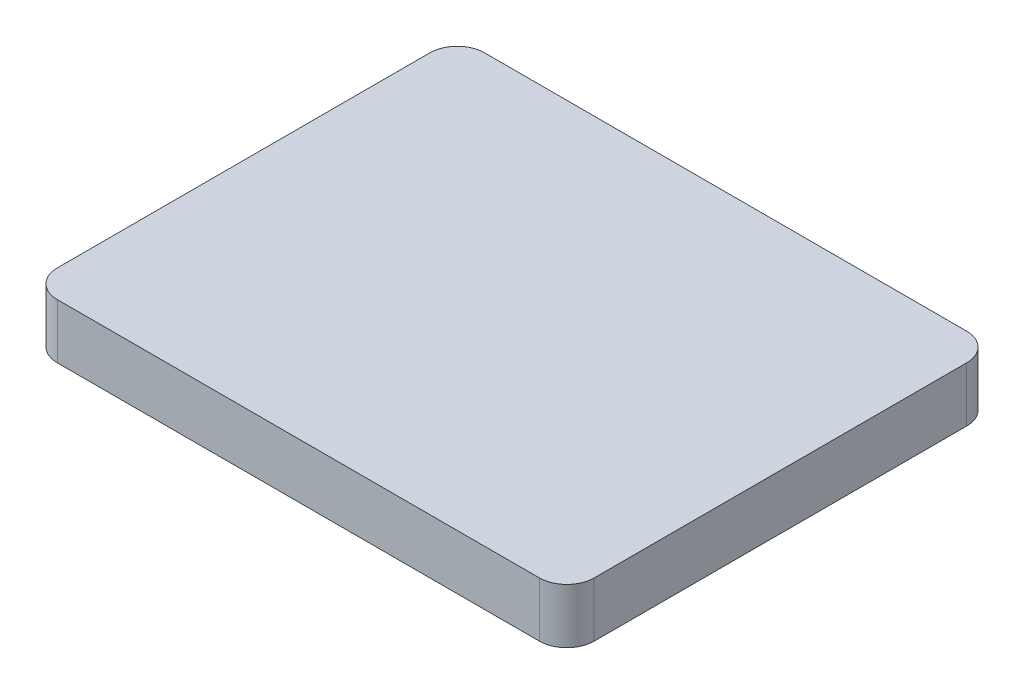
ISO-10303-21;
HEADER;
FILE_DESCRIPTION(('STEP AP214'),'2;1');
FILE_NAME('part.step','',(''),(''),'','','');
FILE_SCHEMA(('AUTOMOTIVE_DESIGN { 1 0 10303 214 1 1 1 1 }'));
ENDSEC;
DATA;
#1=APPLICATION_CONTEXT('core data for automotive mechanical design processes');
#2=APPLICATION_PROTOCOL_DEFINITION('international standard','automotive_design',2000,#1);
#3=PRODUCT_CONTEXT('',#1,'mechanical');
#4=PRODUCT('Part','Part','',(#3));
#5=PRODUCT_RELATED_PRODUCT_CATEGORY('part','',(#4));
#6=PRODUCT_DEFINITION_FORMATION('','',#4);
#7=PRODUCT_DEFINITION_CONTEXT('part definition',#1,'design');
#8=PRODUCT_DEFINITION('design','',#6,#7);
#9=PRODUCT_DEFINITION_SHAPE('','',#8);
#10=(LENGTH_UNIT() NAMED_UNIT(*) SI_UNIT(.MILLI.,.METRE.));
#11=(NAMED_UNIT(*) PLANE_ANGLE_UNIT() SI_UNIT($,.RADIAN.));
#12=(NAMED_UNIT(*) SI_UNIT($,.STERADIAN.) SOLID_ANGLE_UNIT());
#13=UNCERTAINTY_MEASURE_WITH_UNIT(LENGTH_MEASURE(1.E-05),#10,'distance_accuracy_value','');
#14=(GEOMETRIC_REPRESENTATION_CONTEXT(3) GLOBAL_UNCERTAINTY_ASSIGNED_CONTEXT((#13)) GLOBAL_UNIT_ASSIGNED_CONTEXT((#10,
#11,#12)) REPRESENTATION_CONTEXT('',''));
#15=CARTESIAN_POINT('',(0.,0.,0.));
#16=DIRECTION('',(0.,0.,1.));
#17=DIRECTION('',(1.,0.,0.));
#18=AXIS2_PLACEMENT_3D('',#15,#16,#17);
#19=CARTESIAN_POINT('',(4.9,1.,-3.9));
#20=DIRECTION('',(-1.,0.,0.));
#21=DIRECTION('',(0.,0.,1.));
#22=AXIS2_PLACEMENT_3D('',#19,#20,#21);
#23=PLANE('',#22);
#24=DIRECTION('',(0.,0.,-1.));
#25=VECTOR('',#24,1.);
#26=CARTESIAN_POINT('',(4.9,0.,-3.9));
#27=LINE('',#26,#25);
#28=CARTESIAN_POINT('',(4.9,0.,3.4));
#29=VERTEX_POINT('',#28);
#30=CARTESIAN_POINT('',(4.9,0.,-3.4));
#31=VERTEX_POINT('',#30);
#32=EDGE_CURVE('E127',#29,#31,#27,.T.);
#33=ORIENTED_EDGE('',*,*,#32,.T.);
#34=DIRECTION('',(0.,-1.,0.));
#35=VECTOR('',#34,1.);
#36=CARTESIAN_POINT('',(4.9,1.,-3.4));
#37=LINE('',#36,#35);
#38=CARTESIAN_POINT('',(4.9,1.,-3.4));
#39=VERTEX_POINT('',#38);
#40=EDGE_CURVE('E105',#31,#39,#37,.F.);
#41=ORIENTED_EDGE('',*,*,#40,.T.);
#42=DIRECTION('',(0.,0.,-1.));
#43=VECTOR('',#42,1.);
#44=CARTESIAN_POINT('',(4.9,1.,-3.9));
#45=LINE('',#44,#43);
#46=CARTESIAN_POINT('',(4.9,1.,3.4));
#47=VERTEX_POINT('',#46);
#48=EDGE_CURVE('E136',#47,#39,#45,.T.);
#49=ORIENTED_EDGE('',*,*,#48,.F.);
#50=DIRECTION('',(0.,-1.,0.));
#51=VECTOR('',#50,1.);
#52=CARTESIAN_POINT('',(4.9,1.,3.4));
#53=LINE('',#52,#51);
#54=EDGE_CURVE('E110',#47,#29,#53,.T.);
#55=ORIENTED_EDGE('',*,*,#54,.T.);
#56=EDGE_LOOP('',(#33,#41,#49,#55));
#57=FACE_BOUND('',#56,.T.);
#58=ADVANCED_FACE('F34',(#57),#23,.F.);
#59=CARTESIAN_POINT('',(-4.9,1.,-3.9));
#60=DIRECTION('',(0.,0.,1.));
#61=DIRECTION('',(1.,0.,0.));
#62=AXIS2_PLACEMENT_3D('',#59,#60,#61);
#63=PLANE('',#62);
#64=DIRECTION('',(-1.,0.,0.));
#65=VECTOR('',#64,1.);
#66=CARTESIAN_POINT('',(-4.9,1.,-3.9));
#67=LINE('',#66,#65);
#68=CARTESIAN_POINT('',(4.4,1.,-3.9));
#69=VERTEX_POINT('',#68);
#70=CARTESIAN_POINT('',(-4.4,1.,-3.9));
#71=VERTEX_POINT('',#70);
#72=EDGE_CURVE('E120',#69,#71,#67,.T.);
#73=ORIENTED_EDGE('',*,*,#72,.F.);
#74=DIRECTION('',(0.,-1.,0.));
#75=VECTOR('',#74,1.);
#76=CARTESIAN_POINT('',(4.4,1.,-3.9));
#77=LINE('',#76,#75);
#78=CARTESIAN_POINT('',(4.4,0.,-3.9));
#79=VERTEX_POINT('',#78);
#80=EDGE_CURVE('E104',#69,#79,#77,.T.);
#81=ORIENTED_EDGE('',*,*,#80,.T.);
#82=DIRECTION('',(-1.,0.,0.));
#83=VECTOR('',#82,1.);
#84=CARTESIAN_POINT('',(-4.9,0.,-3.9));
#85=LINE('',#84,#83);
#86=CARTESIAN_POINT('',(-4.4,0.,-3.9));
#87=VERTEX_POINT('',#86);
#88=EDGE_CURVE('E117',#79,#87,#85,.T.);
#89=ORIENTED_EDGE('',*,*,#88,.T.);
#90=DIRECTION('',(0.,-1.,0.));
#91=VECTOR('',#90,1.);
#92=CARTESIAN_POINT('',(-4.4,1.,-3.9));
#93=LINE('',#92,#91);
#94=EDGE_CURVE('E122',#87,#71,#93,.F.);
#95=ORIENTED_EDGE('',*,*,#94,.T.);
#96=EDGE_LOOP('',(#73,#81,#89,#95));
#97=FACE_BOUND('',#96,.T.);
#98=ADVANCED_FACE('F116',(#97),#63,.F.);
#99=CARTESIAN_POINT('',(-4.9,1.,-3.9));
#100=DIRECTION('',(1.,0.,0.));
#101=DIRECTION('',(0.,0.,-1.));
#102=AXIS2_PLACEMENT_3D('',#99,#100,#101);
#103=PLANE('',#102);
#104=DIRECTION('',(0.,0.,1.));
#105=VECTOR('',#104,1.);
#106=CARTESIAN_POINT('',(-4.9,1.,-3.9));
#107=LINE('',#106,#105);
#108=CARTESIAN_POINT('',(-4.9,1.,-3.4));
#109=VERTEX_POINT('',#108);
#110=CARTESIAN_POINT('',(-4.9,1.,3.4));
#111=VERTEX_POINT('',#110);
#112=EDGE_CURVE('E162',#109,#111,#107,.T.);
#113=ORIENTED_EDGE('',*,*,#112,.F.);
#114=DIRECTION('',(0.,-1.,0.));
#115=VECTOR('',#114,1.);
#116=CARTESIAN_POINT('',(-4.9,1.,-3.4));
#117=LINE('',#116,#115);
#118=CARTESIAN_POINT('',(-4.9,0.,-3.4));
#119=VERTEX_POINT('',#118);
#120=EDGE_CURVE('E155',#109,#119,#117,.T.);
#121=ORIENTED_EDGE('',*,*,#120,.T.);
#122=DIRECTION('',(0.,0.,1.));
#123=VECTOR('',#122,1.);
#124=CARTESIAN_POINT('',(-4.9,0.,-3.9));
#125=LINE('',#124,#123);
#126=CARTESIAN_POINT('',(-4.9,0.,3.4));
#127=VERTEX_POINT('',#126);
#128=EDGE_CURVE('E126',#119,#127,#125,.T.);
#129=ORIENTED_EDGE('',*,*,#128,.T.);
#130=DIRECTION('',(0.,-1.,0.));
#131=VECTOR('',#130,1.);
#132=CARTESIAN_POINT('',(-4.9,1.,3.4));
#133=LINE('',#132,#131);
#134=EDGE_CURVE('E153',#127,#111,#133,.F.);
#135=ORIENTED_EDGE('',*,*,#134,.T.);
#136=EDGE_LOOP('',(#113,#121,#129,#135));
#137=FACE_BOUND('',#136,.T.);
#138=ADVANCED_FACE('F160',(#137),#103,.F.);
#139=CARTESIAN_POINT('',(-4.9,1.,3.9));
#140=DIRECTION('',(0.,0.,-1.));
#141=DIRECTION('',(-1.,0.,0.));
#142=AXIS2_PLACEMENT_3D('',#139,#140,#141);
#143=PLANE('',#142);
#144=DIRECTION('',(1.,0.,0.));
#145=VECTOR('',#144,1.);
#146=CARTESIAN_POINT('',(-4.9,1.,3.9));
#147=LINE('',#146,#145);
#148=CARTESIAN_POINT('',(-4.4,1.,3.9));
#149=VERTEX_POINT('',#148);
#150=CARTESIAN_POINT('',(4.4,1.,3.9));
#151=VERTEX_POINT('',#150);
#152=EDGE_CURVE('E137',#149,#151,#147,.T.);
#153=ORIENTED_EDGE('',*,*,#152,.F.);
#154=DIRECTION('',(0.,-1.,0.));
#155=VECTOR('',#154,1.);
#156=CARTESIAN_POINT('',(-4.4,1.,3.9));
#157=LINE('',#156,#155);
#158=CARTESIAN_POINT('',(-4.4,0.,3.9));
#159=VERTEX_POINT('',#158);
#160=EDGE_CURVE('E11',#149,#159,#157,.T.);
#161=ORIENTED_EDGE('',*,*,#160,.T.);
#162=DIRECTION('',(1.,0.,0.));
#163=VECTOR('',#162,1.);
#164=CARTESIAN_POINT('',(-4.9,0.,3.9));
#165=LINE('',#164,#163);
#166=CARTESIAN_POINT('',(4.4,0.,3.9));
#167=VERTEX_POINT('',#166);
#168=EDGE_CURVE('E130',#159,#167,#165,.T.);
#169=ORIENTED_EDGE('',*,*,#168,.T.);
#170=DIRECTION('',(0.,-1.,0.));
#171=VECTOR('',#170,1.);
#172=CARTESIAN_POINT('',(4.4,1.,3.9));
#173=LINE('',#172,#171);
#174=EDGE_CURVE('E42',#167,#151,#173,.F.);
#175=ORIENTED_EDGE('',*,*,#174,.T.);
#176=EDGE_LOOP('',(#153,#161,#169,#175));
#177=FACE_BOUND('',#176,.T.);
#178=ADVANCED_FACE('F169',(#177),#143,.F.);
#179=CARTESIAN_POINT('',(0.,1.,0.));
#180=DIRECTION('',(0.,1.,0.));
#181=DIRECTION('',(0.,0.,1.));
#182=AXIS2_PLACEMENT_3D('',#179,#180,#181);
#183=PLANE('',#182);
#184=ORIENTED_EDGE('',*,*,#48,.T.);
#185=CARTESIAN_POINT('',(4.4,1.,-3.4));
#186=DIRECTION('',(0.,1.,0.));
#187=DIRECTION('',(0.,0.,1.));
#188=AXIS2_PLACEMENT_3D('',#185,#186,#187);
#189=CIRCLE('',#188,0.5);
#190=EDGE_CURVE('E151',#39,#69,#189,.T.);
#191=ORIENTED_EDGE('',*,*,#190,.T.);
#192=ORIENTED_EDGE('',*,*,#72,.T.);
#193=CARTESIAN_POINT('',(-4.4,1.,-3.4));
#194=DIRECTION('',(0.,1.,0.));
#195=DIRECTION('',(0.,0.,1.));
#196=AXIS2_PLACEMENT_3D('',#193,#194,#195);
#197=CIRCLE('',#196,0.5);
#198=EDGE_CURVE('E149',#71,#109,#197,.T.);
#199=ORIENTED_EDGE('',*,*,#198,.T.);
#200=ORIENTED_EDGE('',*,*,#112,.T.);
#201=CARTESIAN_POINT('',(-4.4,1.,3.4));
#202=DIRECTION('',(0.,1.,0.));
#203=DIRECTION('',(0.,0.,1.));
#204=AXIS2_PLACEMENT_3D('',#201,#202,#203);
#205=CIRCLE('',#204,0.5);
#206=EDGE_CURVE('E55',#111,#149,#205,.T.);
#207=ORIENTED_EDGE('',*,*,#206,.T.);
#208=ORIENTED_EDGE('',*,*,#152,.T.);
#209=CARTESIAN_POINT('',(4.4,1.,3.4));
#210=DIRECTION('',(0.,1.,0.));
#211=DIRECTION('',(0.,0.,1.));
#212=AXIS2_PLACEMENT_3D('',#209,#210,#211);
#213=CIRCLE('',#212,0.5);
#214=EDGE_CURVE('E146',#151,#47,#213,.T.);
#215=ORIENTED_EDGE('',*,*,#214,.T.);
#216=EDGE_LOOP('',(#184,#191,#192,#199,#200,#207,#208,#215));
#217=FACE_BOUND('',#216,.T.);
#218=ADVANCED_FACE('F176',(#217),#183,.T.);
#219=CARTESIAN_POINT('',(0.,0.,0.));
#220=DIRECTION('',(0.,1.,0.));
#221=DIRECTION('',(0.,0.,1.));
#222=AXIS2_PLACEMENT_3D('',#219,#220,#221);
#223=PLANE('',#222);
#224=ORIENTED_EDGE('',*,*,#88,.F.);
#225=CARTESIAN_POINT('',(4.4,0.,-3.4));
#226=DIRECTION('',(0.,1.,0.));
#227=DIRECTION('',(0.,0.,1.));
#228=AXIS2_PLACEMENT_3D('',#225,#226,#227);
#229=CIRCLE('',#228,0.5);
#230=EDGE_CURVE('E100',#79,#31,#229,.F.);
#231=ORIENTED_EDGE('',*,*,#230,.T.);
#232=ORIENTED_EDGE('',*,*,#32,.F.);
#233=CARTESIAN_POINT('',(4.4,0.,3.4));
#234=DIRECTION('',(0.,1.,0.));
#235=DIRECTION('',(0.,0.,1.));
#236=AXIS2_PLACEMENT_3D('',#233,#234,#235);
#237=CIRCLE('',#236,0.5);
#238=EDGE_CURVE('E121',#29,#167,#237,.F.);
#239=ORIENTED_EDGE('',*,*,#238,.T.);
#240=ORIENTED_EDGE('',*,*,#168,.F.);
#241=CARTESIAN_POINT('',(-4.4,0.,3.4));
#242=DIRECTION('',(0.,1.,0.));
#243=DIRECTION('',(0.,0.,1.));
#244=AXIS2_PLACEMENT_3D('',#241,#242,#243);
#245=CIRCLE('',#244,0.5);
#246=EDGE_CURVE('E140',#159,#127,#245,.F.);
#247=ORIENTED_EDGE('',*,*,#246,.T.);
#248=ORIENTED_EDGE('',*,*,#128,.F.);
#249=CARTESIAN_POINT('',(-4.4,0.,-3.4));
#250=DIRECTION('',(0.,1.,0.));
#251=DIRECTION('',(0.,0.,1.));
#252=AXIS2_PLACEMENT_3D('',#249,#250,#251);
#253=CIRCLE('',#252,0.5);
#254=EDGE_CURVE('E111',#119,#87,#253,.F.);
#255=ORIENTED_EDGE('',*,*,#254,.T.);
#256=EDGE_LOOP('',(#224,#231,#232,#239,#240,#247,#248,#255));
#257=FACE_BOUND('',#256,.T.);
#258=ADVANCED_FACE('F124',(#257),#223,.F.);
#259=CARTESIAN_POINT('',(4.4,1.,-3.4));
#260=DIRECTION('',(0.,-1.,0.));
#261=DIRECTION('',(0.,0.,-1.));
#262=AXIS2_PLACEMENT_3D('',#259,#260,#261);
#263=CYLINDRICAL_SURFACE('',#262,0.5);
#264=ORIENTED_EDGE('',*,*,#190,.F.);
#265=ORIENTED_EDGE('',*,*,#40,.F.);
#266=ORIENTED_EDGE('',*,*,#230,.F.);
#267=ORIENTED_EDGE('',*,*,#80,.F.);
#268=EDGE_LOOP('',(#264,#265,#266,#267));
#269=FACE_BOUND('',#268,.T.);
#270=ADVANCED_FACE('F103',(#269),#263,.T.);
#271=CARTESIAN_POINT('',(-4.4,1.,-3.4));
#272=DIRECTION('',(0.,-1.,0.));
#273=DIRECTION('',(0.,0.,-1.));
#274=AXIS2_PLACEMENT_3D('',#271,#272,#273);
#275=CYLINDRICAL_SURFACE('',#274,0.5);
#276=ORIENTED_EDGE('',*,*,#198,.F.);
#277=ORIENTED_EDGE('',*,*,#94,.F.);
#278=ORIENTED_EDGE('',*,*,#254,.F.);
#279=ORIENTED_EDGE('',*,*,#120,.F.);
#280=EDGE_LOOP('',(#276,#277,#278,#279));
#281=FACE_BOUND('',#280,.T.);
#282=ADVANCED_FACE('F184',(#281),#275,.T.);
#283=CARTESIAN_POINT('',(-4.4,1.,3.4));
#284=DIRECTION('',(0.,-1.,0.));
#285=DIRECTION('',(0.,0.,-1.));
#286=AXIS2_PLACEMENT_3D('',#283,#284,#285);
#287=CYLINDRICAL_SURFACE('',#286,0.5);
#288=ORIENTED_EDGE('',*,*,#206,.F.);
#289=ORIENTED_EDGE('',*,*,#134,.F.);
#290=ORIENTED_EDGE('',*,*,#246,.F.);
#291=ORIENTED_EDGE('',*,*,#160,.F.);
#292=EDGE_LOOP('',(#288,#289,#290,#291));
#293=FACE_BOUND('',#292,.T.);
#294=ADVANCED_FACE('F168',(#293),#287,.T.);
#295=CARTESIAN_POINT('',(4.4,1.,3.4));
#296=DIRECTION('',(0.,-1.,0.));
#297=DIRECTION('',(0.,0.,-1.));
#298=AXIS2_PLACEMENT_3D('',#295,#296,#297);
#299=CYLINDRICAL_SURFACE('',#298,0.5);
#300=ORIENTED_EDGE('',*,*,#214,.F.);
#301=ORIENTED_EDGE('',*,*,#174,.F.);
#302=ORIENTED_EDGE('',*,*,#238,.F.);
#303=ORIENTED_EDGE('',*,*,#54,.F.);
#304=EDGE_LOOP('',(#300,#301,#302,#303));
#305=FACE_BOUND('',#304,.T.);
#306=ADVANCED_FACE('F36',(#305),#299,.T.);
#307=CLOSED_SHELL('',(#58,#98,#138,#178,#218,#258,#270,#282,#294,#306));
#308=MANIFOLD_SOLID_BREP('B2',#307);
#309=ADVANCED_BREP_SHAPE_REPRESENTATION('',(#18,#308),#14);
#310=SHAPE_DEFINITION_REPRESENTATION(#9,#309);
ENDSEC;
END-ISO-10303-21;
